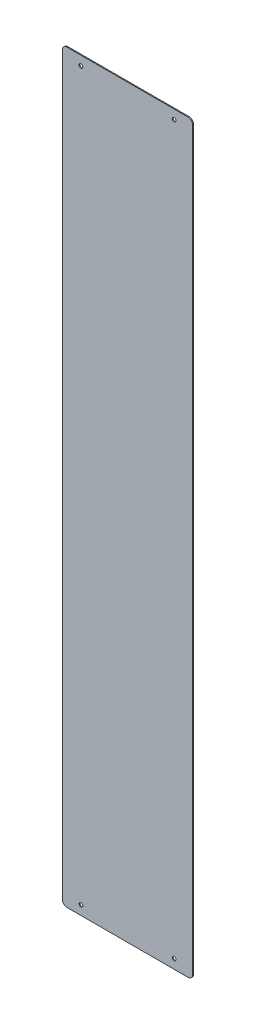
ISO-10303-21;
HEADER;
FILE_DESCRIPTION(('STEP AP214'),'2;1');
FILE_NAME('part.step','',(''),(''),'','','');
FILE_SCHEMA(('AUTOMOTIVE_DESIGN { 1 0 10303 214 1 1 1 1 }'));
ENDSEC;
DATA;
#1=APPLICATION_CONTEXT('core data for automotive mechanical design processes');
#2=APPLICATION_PROTOCOL_DEFINITION('international standard','automotive_design',2000,#1);
#3=PRODUCT_CONTEXT('',#1,'mechanical');
#4=PRODUCT('Part','Part','',(#3));
#5=PRODUCT_RELATED_PRODUCT_CATEGORY('part','',(#4));
#6=PRODUCT_DEFINITION_FORMATION('','',#4);
#7=PRODUCT_DEFINITION_CONTEXT('part definition',#1,'design');
#8=PRODUCT_DEFINITION('design','',#6,#7);
#9=PRODUCT_DEFINITION_SHAPE('','',#8);
#10=(LENGTH_UNIT() NAMED_UNIT(*) SI_UNIT(.MILLI.,.METRE.));
#11=(NAMED_UNIT(*) PLANE_ANGLE_UNIT() SI_UNIT($,.RADIAN.));
#12=(NAMED_UNIT(*) SI_UNIT($,.STERADIAN.) SOLID_ANGLE_UNIT());
#13=UNCERTAINTY_MEASURE_WITH_UNIT(LENGTH_MEASURE(1.E-05),#10,'distance_accuracy_value','');
#14=(GEOMETRIC_REPRESENTATION_CONTEXT(3) GLOBAL_UNCERTAINTY_ASSIGNED_CONTEXT((#13)) GLOBAL_UNIT_ASSIGNED_CONTEXT((#10,
#11,#12)) REPRESENTATION_CONTEXT('',''));
#15=CARTESIAN_POINT('',(0.,0.,0.));
#16=DIRECTION('',(0.,0.,1.));
#17=DIRECTION('',(1.,0.,0.));
#18=AXIS2_PLACEMENT_3D('',#15,#16,#17);
#19=CARTESIAN_POINT('',(-65.,-395.,1.));
#20=DIRECTION('',(0.,0.,-1.));
#21=DIRECTION('',(-1.,0.,0.));
#22=AXIS2_PLACEMENT_3D('',#19,#20,#21);
#23=PLANE('',#22);
#24=CARTESIAN_POINT('',(-65.,-395.,1.));
#25=DIRECTION('',(0.,0.,1.));
#26=DIRECTION('',(-1.,0.,0.));
#27=AXIS2_PLACEMENT_3D('',#24,#25,#26);
#28=CIRCLE('',#27,5.);
#29=CARTESIAN_POINT('',(-70.,-395.,1.));
#30=VERTEX_POINT('',#29);
#31=CARTESIAN_POINT('',(-65.,-400.,1.));
#32=VERTEX_POINT('',#31);
#33=EDGE_CURVE('E144',#30,#32,#28,.T.);
#34=ORIENTED_EDGE('',*,*,#33,.T.);
#35=DIRECTION('',(1.,0.,0.));
#36=VECTOR('',#35,1.);
#37=CARTESIAN_POINT('',(65.,-400.,1.));
#38=LINE('',#37,#36);
#39=CARTESIAN_POINT('',(65.,-400.,1.));
#40=VERTEX_POINT('',#39);
#41=EDGE_CURVE('E92',#32,#40,#38,.T.);
#42=ORIENTED_EDGE('',*,*,#41,.T.);
#43=CARTESIAN_POINT('',(65.,-395.,1.));
#44=DIRECTION('',(0.,0.,1.));
#45=DIRECTION('',(1.,0.,0.));
#46=AXIS2_PLACEMENT_3D('',#43,#44,#45);
#47=CIRCLE('',#46,5.);
#48=CARTESIAN_POINT('',(70.,-395.,1.));
#49=VERTEX_POINT('',#48);
#50=EDGE_CURVE('E159',#40,#49,#47,.T.);
#51=ORIENTED_EDGE('',*,*,#50,.T.);
#52=DIRECTION('',(0.,1.,0.));
#53=VECTOR('',#52,1.);
#54=CARTESIAN_POINT('',(70.,-395.,1.));
#55=LINE('',#54,#53);
#56=CARTESIAN_POINT('',(70.,395.,1.));
#57=VERTEX_POINT('',#56);
#58=EDGE_CURVE('E172',#49,#57,#55,.T.);
#59=ORIENTED_EDGE('',*,*,#58,.T.);
#60=CARTESIAN_POINT('',(65.,395.,1.));
#61=DIRECTION('',(0.,0.,1.));
#62=DIRECTION('',(1.,0.,0.));
#63=AXIS2_PLACEMENT_3D('',#60,#61,#62);
#64=CIRCLE('',#63,5.);
#65=CARTESIAN_POINT('',(65.,400.,1.));
#66=VERTEX_POINT('',#65);
#67=EDGE_CURVE('E111',#57,#66,#64,.T.);
#68=ORIENTED_EDGE('',*,*,#67,.T.);
#69=DIRECTION('',(-1.,0.,0.));
#70=VECTOR('',#69,1.);
#71=CARTESIAN_POINT('',(65.,400.,1.));
#72=LINE('',#71,#70);
#73=CARTESIAN_POINT('',(-65.,400.,1.));
#74=VERTEX_POINT('',#73);
#75=EDGE_CURVE('E105',#66,#74,#72,.T.);
#76=ORIENTED_EDGE('',*,*,#75,.T.);
#77=CARTESIAN_POINT('',(-65.,395.,1.));
#78=DIRECTION('',(0.,0.,1.));
#79=DIRECTION('',(1.,0.,0.));
#80=AXIS2_PLACEMENT_3D('',#77,#78,#79);
#81=CIRCLE('',#80,5.);
#82=CARTESIAN_POINT('',(-70.,395.,1.));
#83=VERTEX_POINT('',#82);
#84=EDGE_CURVE('E109',#74,#83,#81,.T.);
#85=ORIENTED_EDGE('',*,*,#84,.T.);
#86=DIRECTION('',(0.,-1.,0.));
#87=VECTOR('',#86,1.);
#88=CARTESIAN_POINT('',(-70.,-395.,1.));
#89=LINE('',#88,#87);
#90=EDGE_CURVE('E49',#83,#30,#89,.T.);
#91=ORIENTED_EDGE('',*,*,#90,.T.);
#92=EDGE_LOOP('',(#34,#42,#51,#59,#68,#76,#85,#91));
#93=FACE_BOUND('',#92,.T.);
#94=CARTESIAN_POINT('',(-50.,390.,1.));
#95=DIRECTION('',(0.,0.,1.));
#96=DIRECTION('',(1.,0.,0.));
#97=AXIS2_PLACEMENT_3D('',#94,#95,#96);
#98=CIRCLE('',#97,2.);
#99=CARTESIAN_POINT('',(-48.,390.,1.));
#100=VERTEX_POINT('',#99);
#101=EDGE_CURVE('E133',#100,#100,#98,.T.);
#102=ORIENTED_EDGE('',*,*,#101,.F.);
#103=EDGE_LOOP('',(#102));
#104=FACE_BOUND('',#103,.T.);
#105=CARTESIAN_POINT('',(50.,390.,1.));
#106=DIRECTION('',(0.,0.,1.));
#107=DIRECTION('',(-1.,0.,0.));
#108=AXIS2_PLACEMENT_3D('',#105,#106,#107);
#109=CIRCLE('',#108,2.);
#110=CARTESIAN_POINT('',(48.,390.,1.));
#111=VERTEX_POINT('',#110);
#112=EDGE_CURVE('E181',#111,#111,#109,.T.);
#113=ORIENTED_EDGE('',*,*,#112,.F.);
#114=EDGE_LOOP('',(#113));
#115=FACE_BOUND('',#114,.T.);
#116=CARTESIAN_POINT('',(50.0000000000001,-390.,1.));
#117=DIRECTION('',(0.,0.,1.));
#118=DIRECTION('',(1.,0.,0.));
#119=AXIS2_PLACEMENT_3D('',#116,#117,#118);
#120=CIRCLE('',#119,2.);
#121=CARTESIAN_POINT('',(52.0000000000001,-390.,1.));
#122=VERTEX_POINT('',#121);
#123=EDGE_CURVE('E187',#122,#122,#120,.T.);
#124=ORIENTED_EDGE('',*,*,#123,.F.);
#125=EDGE_LOOP('',(#124));
#126=FACE_BOUND('',#125,.T.);
#127=CARTESIAN_POINT('',(-49.9999999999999,-390.,1.));
#128=DIRECTION('',(0.,0.,1.));
#129=DIRECTION('',(-1.,0.,0.));
#130=AXIS2_PLACEMENT_3D('',#127,#128,#129);
#131=CIRCLE('',#130,2.);
#132=CARTESIAN_POINT('',(-51.9999999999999,-390.,1.));
#133=VERTEX_POINT('',#132);
#134=EDGE_CURVE('E193',#133,#133,#131,.T.);
#135=ORIENTED_EDGE('',*,*,#134,.F.);
#136=EDGE_LOOP('',(#135));
#137=FACE_BOUND('',#136,.T.);
#138=ADVANCED_FACE('F32',(#93,#104,#115,#126,#137),#23,.F.);
#139=CARTESIAN_POINT('',(-65.,-395.,0.));
#140=DIRECTION('',(0.,0.,-1.));
#141=DIRECTION('',(-1.,0.,0.));
#142=AXIS2_PLACEMENT_3D('',#139,#140,#141);
#143=PLANE('',#142);
#144=CARTESIAN_POINT('',(50.0000000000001,-390.,0.));
#145=DIRECTION('',(0.,0.,1.));
#146=DIRECTION('',(1.,0.,0.));
#147=AXIS2_PLACEMENT_3D('',#144,#145,#146);
#148=CIRCLE('',#147,2.);
#149=CARTESIAN_POINT('',(52.0000000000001,-390.,0.));
#150=VERTEX_POINT('',#149);
#151=EDGE_CURVE('E190',#150,#150,#148,.T.);
#152=ORIENTED_EDGE('',*,*,#151,.T.);
#153=EDGE_LOOP('',(#152));
#154=FACE_BOUND('',#153,.T.);
#155=CARTESIAN_POINT('',(-50.,390.,0.));
#156=DIRECTION('',(0.,0.,1.));
#157=DIRECTION('',(1.,0.,0.));
#158=AXIS2_PLACEMENT_3D('',#155,#156,#157);
#159=CIRCLE('',#158,2.);
#160=CARTESIAN_POINT('',(-48.,390.,0.));
#161=VERTEX_POINT('',#160);
#162=EDGE_CURVE('E178',#161,#161,#159,.T.);
#163=ORIENTED_EDGE('',*,*,#162,.T.);
#164=EDGE_LOOP('',(#163));
#165=FACE_BOUND('',#164,.T.);
#166=CARTESIAN_POINT('',(-65.,-395.,0.));
#167=DIRECTION('',(0.,0.,1.));
#168=DIRECTION('',(-1.,0.,0.));
#169=AXIS2_PLACEMENT_3D('',#166,#167,#168);
#170=CIRCLE('',#169,5.);
#171=CARTESIAN_POINT('',(-70.,-395.,0.));
#172=VERTEX_POINT('',#171);
#173=CARTESIAN_POINT('',(-65.,-400.,0.));
#174=VERTEX_POINT('',#173);
#175=EDGE_CURVE('E129',#172,#174,#170,.T.);
#176=ORIENTED_EDGE('',*,*,#175,.F.);
#177=DIRECTION('',(0.,-1.,0.));
#178=VECTOR('',#177,1.);
#179=CARTESIAN_POINT('',(-70.,-395.,0.));
#180=LINE('',#179,#178);
#181=CARTESIAN_POINT('',(-70.,395.,0.));
#182=VERTEX_POINT('',#181);
#183=EDGE_CURVE('E84',#182,#172,#180,.T.);
#184=ORIENTED_EDGE('',*,*,#183,.F.);
#185=CARTESIAN_POINT('',(-65.,395.,0.));
#186=DIRECTION('',(0.,0.,1.));
#187=DIRECTION('',(1.,0.,0.));
#188=AXIS2_PLACEMENT_3D('',#185,#186,#187);
#189=CIRCLE('',#188,5.);
#190=CARTESIAN_POINT('',(-65.,400.,0.));
#191=VERTEX_POINT('',#190);
#192=EDGE_CURVE('E78',#191,#182,#189,.T.);
#193=ORIENTED_EDGE('',*,*,#192,.F.);
#194=DIRECTION('',(-1.,0.,0.));
#195=VECTOR('',#194,1.);
#196=CARTESIAN_POINT('',(65.,400.,0.));
#197=LINE('',#196,#195);
#198=CARTESIAN_POINT('',(65.,400.,0.));
#199=VERTEX_POINT('',#198);
#200=EDGE_CURVE('E119',#199,#191,#197,.T.);
#201=ORIENTED_EDGE('',*,*,#200,.F.);
#202=CARTESIAN_POINT('',(65.,395.,0.));
#203=DIRECTION('',(0.,0.,1.));
#204=DIRECTION('',(1.,0.,0.));
#205=AXIS2_PLACEMENT_3D('',#202,#203,#204);
#206=CIRCLE('',#205,5.);
#207=CARTESIAN_POINT('',(70.,395.,0.));
#208=VERTEX_POINT('',#207);
#209=EDGE_CURVE('E139',#208,#199,#206,.T.);
#210=ORIENTED_EDGE('',*,*,#209,.F.);
#211=DIRECTION('',(0.,1.,0.));
#212=VECTOR('',#211,1.);
#213=CARTESIAN_POINT('',(70.,-395.,0.));
#214=LINE('',#213,#212);
#215=CARTESIAN_POINT('',(70.,-395.,0.));
#216=VERTEX_POINT('',#215);
#217=EDGE_CURVE('E137',#216,#208,#214,.T.);
#218=ORIENTED_EDGE('',*,*,#217,.F.);
#219=CARTESIAN_POINT('',(65.,-395.,0.));
#220=DIRECTION('',(0.,0.,1.));
#221=DIRECTION('',(1.,0.,0.));
#222=AXIS2_PLACEMENT_3D('',#219,#220,#221);
#223=CIRCLE('',#222,5.);
#224=CARTESIAN_POINT('',(65.,-400.,0.));
#225=VERTEX_POINT('',#224);
#226=EDGE_CURVE('E135',#225,#216,#223,.T.);
#227=ORIENTED_EDGE('',*,*,#226,.F.);
#228=DIRECTION('',(1.,0.,0.));
#229=VECTOR('',#228,1.);
#230=CARTESIAN_POINT('',(65.,-400.,0.));
#231=LINE('',#230,#229);
#232=EDGE_CURVE('E132',#174,#225,#231,.T.);
#233=ORIENTED_EDGE('',*,*,#232,.F.);
#234=EDGE_LOOP('',(#176,#184,#193,#201,#210,#218,#227,#233));
#235=FACE_BOUND('',#234,.T.);
#236=CARTESIAN_POINT('',(50.,390.,0.));
#237=DIRECTION('',(0.,0.,1.));
#238=DIRECTION('',(-1.,0.,0.));
#239=AXIS2_PLACEMENT_3D('',#236,#237,#238);
#240=CIRCLE('',#239,2.);
#241=CARTESIAN_POINT('',(48.,390.,0.));
#242=VERTEX_POINT('',#241);
#243=EDGE_CURVE('E184',#242,#242,#240,.T.);
#244=ORIENTED_EDGE('',*,*,#243,.T.);
#245=EDGE_LOOP('',(#244));
#246=FACE_BOUND('',#245,.T.);
#247=CARTESIAN_POINT('',(-49.9999999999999,-390.,0.));
#248=DIRECTION('',(0.,0.,1.));
#249=DIRECTION('',(-1.,0.,0.));
#250=AXIS2_PLACEMENT_3D('',#247,#248,#249);
#251=CIRCLE('',#250,2.);
#252=CARTESIAN_POINT('',(-51.9999999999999,-390.,0.));
#253=VERTEX_POINT('',#252);
#254=EDGE_CURVE('E196',#253,#253,#251,.T.);
#255=ORIENTED_EDGE('',*,*,#254,.T.);
#256=EDGE_LOOP('',(#255));
#257=FACE_BOUND('',#256,.T.);
#258=ADVANCED_FACE('F163',(#154,#165,#235,#246,#257),#143,.T.);
#259=CARTESIAN_POINT('',(-65.,-395.,1.));
#260=DIRECTION('',(0.,0.,-1.));
#261=DIRECTION('',(-1.,0.,0.));
#262=AXIS2_PLACEMENT_3D('',#259,#260,#261);
#263=CYLINDRICAL_SURFACE('',#262,5.);
#264=ORIENTED_EDGE('',*,*,#175,.T.);
#265=DIRECTION('',(0.,0.,-1.));
#266=VECTOR('',#265,1.);
#267=CARTESIAN_POINT('',(-65.,-400.,1.));
#268=LINE('',#267,#266);
#269=EDGE_CURVE('E11',#32,#174,#268,.T.);
#270=ORIENTED_EDGE('',*,*,#269,.F.);
#271=ORIENTED_EDGE('',*,*,#33,.F.);
#272=DIRECTION('',(0.,0.,-1.));
#273=VECTOR('',#272,1.);
#274=CARTESIAN_POINT('',(-70.,-395.,1.));
#275=LINE('',#274,#273);
#276=EDGE_CURVE('E125',#30,#172,#275,.T.);
#277=ORIENTED_EDGE('',*,*,#276,.T.);
#278=EDGE_LOOP('',(#264,#270,#271,#277));
#279=FACE_BOUND('',#278,.T.);
#280=ADVANCED_FACE('F34',(#279),#263,.T.);
#281=CARTESIAN_POINT('',(65.,-400.,1.));
#282=DIRECTION('',(0.,1.,0.));
#283=DIRECTION('',(0.,0.,1.));
#284=AXIS2_PLACEMENT_3D('',#281,#282,#283);
#285=PLANE('',#284);
#286=ORIENTED_EDGE('',*,*,#232,.T.);
#287=DIRECTION('',(0.,0.,-1.));
#288=VECTOR('',#287,1.);
#289=CARTESIAN_POINT('',(65.,-400.,1.));
#290=LINE('',#289,#288);
#291=EDGE_CURVE('E41',#40,#225,#290,.T.);
#292=ORIENTED_EDGE('',*,*,#291,.F.);
#293=ORIENTED_EDGE('',*,*,#41,.F.);
#294=ORIENTED_EDGE('',*,*,#269,.T.);
#295=EDGE_LOOP('',(#286,#292,#293,#294));
#296=FACE_BOUND('',#295,.T.);
#297=ADVANCED_FACE('F228',(#296),#285,.F.);
#298=CARTESIAN_POINT('',(65.,-395.,1.));
#299=DIRECTION('',(0.,0.,-1.));
#300=DIRECTION('',(-1.,0.,0.));
#301=AXIS2_PLACEMENT_3D('',#298,#299,#300);
#302=CYLINDRICAL_SURFACE('',#301,5.);
#303=ORIENTED_EDGE('',*,*,#226,.T.);
#304=DIRECTION('',(0.,0.,-1.));
#305=VECTOR('',#304,1.);
#306=CARTESIAN_POINT('',(70.,-395.,1.));
#307=LINE('',#306,#305);
#308=EDGE_CURVE('E151',#49,#216,#307,.T.);
#309=ORIENTED_EDGE('',*,*,#308,.F.);
#310=ORIENTED_EDGE('',*,*,#50,.F.);
#311=ORIENTED_EDGE('',*,*,#291,.T.);
#312=EDGE_LOOP('',(#303,#309,#310,#311));
#313=FACE_BOUND('',#312,.T.);
#314=ADVANCED_FACE('F157',(#313),#302,.T.);
#315=CARTESIAN_POINT('',(70.,-395.,1.));
#316=DIRECTION('',(-1.,0.,0.));
#317=DIRECTION('',(0.,0.,1.));
#318=AXIS2_PLACEMENT_3D('',#315,#316,#317);
#319=PLANE('',#318);
#320=ORIENTED_EDGE('',*,*,#217,.T.);
#321=DIRECTION('',(0.,0.,-1.));
#322=VECTOR('',#321,1.);
#323=CARTESIAN_POINT('',(70.,395.,1.));
#324=LINE('',#323,#322);
#325=EDGE_CURVE('E148',#57,#208,#324,.T.);
#326=ORIENTED_EDGE('',*,*,#325,.F.);
#327=ORIENTED_EDGE('',*,*,#58,.F.);
#328=ORIENTED_EDGE('',*,*,#308,.T.);
#329=EDGE_LOOP('',(#320,#326,#327,#328));
#330=FACE_BOUND('',#329,.T.);
#331=ADVANCED_FACE('F168',(#330),#319,.F.);
#332=CARTESIAN_POINT('',(65.,395.,1.));
#333=DIRECTION('',(0.,0.,-1.));
#334=DIRECTION('',(-1.,0.,0.));
#335=AXIS2_PLACEMENT_3D('',#332,#333,#334);
#336=CYLINDRICAL_SURFACE('',#335,5.);
#337=ORIENTED_EDGE('',*,*,#209,.T.);
#338=DIRECTION('',(0.,0.,-1.));
#339=VECTOR('',#338,1.);
#340=CARTESIAN_POINT('',(65.,400.,1.));
#341=LINE('',#340,#339);
#342=EDGE_CURVE('E120',#66,#199,#341,.T.);
#343=ORIENTED_EDGE('',*,*,#342,.F.);
#344=ORIENTED_EDGE('',*,*,#67,.F.);
#345=ORIENTED_EDGE('',*,*,#325,.T.);
#346=EDGE_LOOP('',(#337,#343,#344,#345));
#347=FACE_BOUND('',#346,.T.);
#348=ADVANCED_FACE('F171',(#347),#336,.T.);
#349=CARTESIAN_POINT('',(65.,400.,1.));
#350=DIRECTION('',(0.,-1.,0.));
#351=DIRECTION('',(0.,0.,-1.));
#352=AXIS2_PLACEMENT_3D('',#349,#350,#351);
#353=PLANE('',#352);
#354=ORIENTED_EDGE('',*,*,#200,.T.);
#355=DIRECTION('',(0.,0.,-1.));
#356=VECTOR('',#355,1.);
#357=CARTESIAN_POINT('',(-65.,400.,1.));
#358=LINE('',#357,#356);
#359=EDGE_CURVE('E116',#74,#191,#358,.T.);
#360=ORIENTED_EDGE('',*,*,#359,.F.);
#361=ORIENTED_EDGE('',*,*,#75,.F.);
#362=ORIENTED_EDGE('',*,*,#342,.T.);
#363=EDGE_LOOP('',(#354,#360,#361,#362));
#364=FACE_BOUND('',#363,.T.);
#365=ADVANCED_FACE('F117',(#364),#353,.F.);
#366=CARTESIAN_POINT('',(-65.,395.,1.));
#367=DIRECTION('',(0.,0.,-1.));
#368=DIRECTION('',(-1.,0.,0.));
#369=AXIS2_PLACEMENT_3D('',#366,#367,#368);
#370=CYLINDRICAL_SURFACE('',#369,5.);
#371=ORIENTED_EDGE('',*,*,#192,.T.);
#372=DIRECTION('',(0.,0.,-1.));
#373=VECTOR('',#372,1.);
#374=CARTESIAN_POINT('',(-70.,395.,1.));
#375=LINE('',#374,#373);
#376=EDGE_CURVE('E121',#83,#182,#375,.T.);
#377=ORIENTED_EDGE('',*,*,#376,.F.);
#378=ORIENTED_EDGE('',*,*,#84,.F.);
#379=ORIENTED_EDGE('',*,*,#359,.T.);
#380=EDGE_LOOP('',(#371,#377,#378,#379));
#381=FACE_BOUND('',#380,.T.);
#382=ADVANCED_FACE('F123',(#381),#370,.T.);
#383=CARTESIAN_POINT('',(-70.,-395.,1.));
#384=DIRECTION('',(1.,0.,0.));
#385=DIRECTION('',(0.,0.,-1.));
#386=AXIS2_PLACEMENT_3D('',#383,#384,#385);
#387=PLANE('',#386);
#388=ORIENTED_EDGE('',*,*,#183,.T.);
#389=ORIENTED_EDGE('',*,*,#276,.F.);
#390=ORIENTED_EDGE('',*,*,#90,.F.);
#391=ORIENTED_EDGE('',*,*,#376,.T.);
#392=EDGE_LOOP('',(#388,#389,#390,#391));
#393=FACE_BOUND('',#392,.T.);
#394=ADVANCED_FACE('F216',(#393),#387,.F.);
#395=CARTESIAN_POINT('',(-50.,390.,1.));
#396=DIRECTION('',(0.,0.,-1.));
#397=DIRECTION('',(-1.,0.,0.));
#398=AXIS2_PLACEMENT_3D('',#395,#396,#397);
#399=CYLINDRICAL_SURFACE('',#398,2.);
#400=ORIENTED_EDGE('',*,*,#101,.T.);
#401=EDGE_LOOP('',(#400));
#402=FACE_BOUND('',#401,.T.);
#403=ORIENTED_EDGE('',*,*,#162,.F.);
#404=EDGE_LOOP('',(#403));
#405=FACE_BOUND('',#404,.T.);
#406=ADVANCED_FACE('F213',(#402,#405),#399,.F.);
#407=CARTESIAN_POINT('',(50.,390.,1.));
#408=DIRECTION('',(0.,0.,-1.));
#409=DIRECTION('',(-1.,0.,0.));
#410=AXIS2_PLACEMENT_3D('',#407,#408,#409);
#411=CYLINDRICAL_SURFACE('',#410,2.);
#412=ORIENTED_EDGE('',*,*,#112,.T.);
#413=EDGE_LOOP('',(#412));
#414=FACE_BOUND('',#413,.T.);
#415=ORIENTED_EDGE('',*,*,#243,.F.);
#416=EDGE_LOOP('',(#415));
#417=FACE_BOUND('',#416,.T.);
#418=ADVANCED_FACE('F292',(#414,#417),#411,.F.);
#419=CARTESIAN_POINT('',(50.0000000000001,-390.,1.));
#420=DIRECTION('',(0.,0.,-1.));
#421=DIRECTION('',(-1.,0.,0.));
#422=AXIS2_PLACEMENT_3D('',#419,#420,#421);
#423=CYLINDRICAL_SURFACE('',#422,2.);
#424=ORIENTED_EDGE('',*,*,#123,.T.);
#425=EDGE_LOOP('',(#424));
#426=FACE_BOUND('',#425,.T.);
#427=ORIENTED_EDGE('',*,*,#151,.F.);
#428=EDGE_LOOP('',(#427));
#429=FACE_BOUND('',#428,.T.);
#430=ADVANCED_FACE('F300',(#426,#429),#423,.F.);
#431=CARTESIAN_POINT('',(-49.9999999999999,-390.,1.));
#432=DIRECTION('',(0.,0.,-1.));
#433=DIRECTION('',(-1.,0.,0.));
#434=AXIS2_PLACEMENT_3D('',#431,#432,#433);
#435=CYLINDRICAL_SURFACE('',#434,2.);
#436=ORIENTED_EDGE('',*,*,#134,.T.);
#437=EDGE_LOOP('',(#436));
#438=FACE_BOUND('',#437,.T.);
#439=ORIENTED_EDGE('',*,*,#254,.F.);
#440=EDGE_LOOP('',(#439));
#441=FACE_BOUND('',#440,.T.);
#442=ADVANCED_FACE('F202',(#438,#441),#435,.F.);
#443=CLOSED_SHELL('',(#138,#258,#280,#297,#314,#331,#348,#365,#382,#394,#406,#418,#430,#442));
#444=MANIFOLD_SOLID_BREP('B2',#443);
#445=ADVANCED_BREP_SHAPE_REPRESENTATION('',(#18,#444),#14);
#446=SHAPE_DEFINITION_REPRESENTATION(#9,#445);
ENDSEC;
END-ISO-10303-21;
